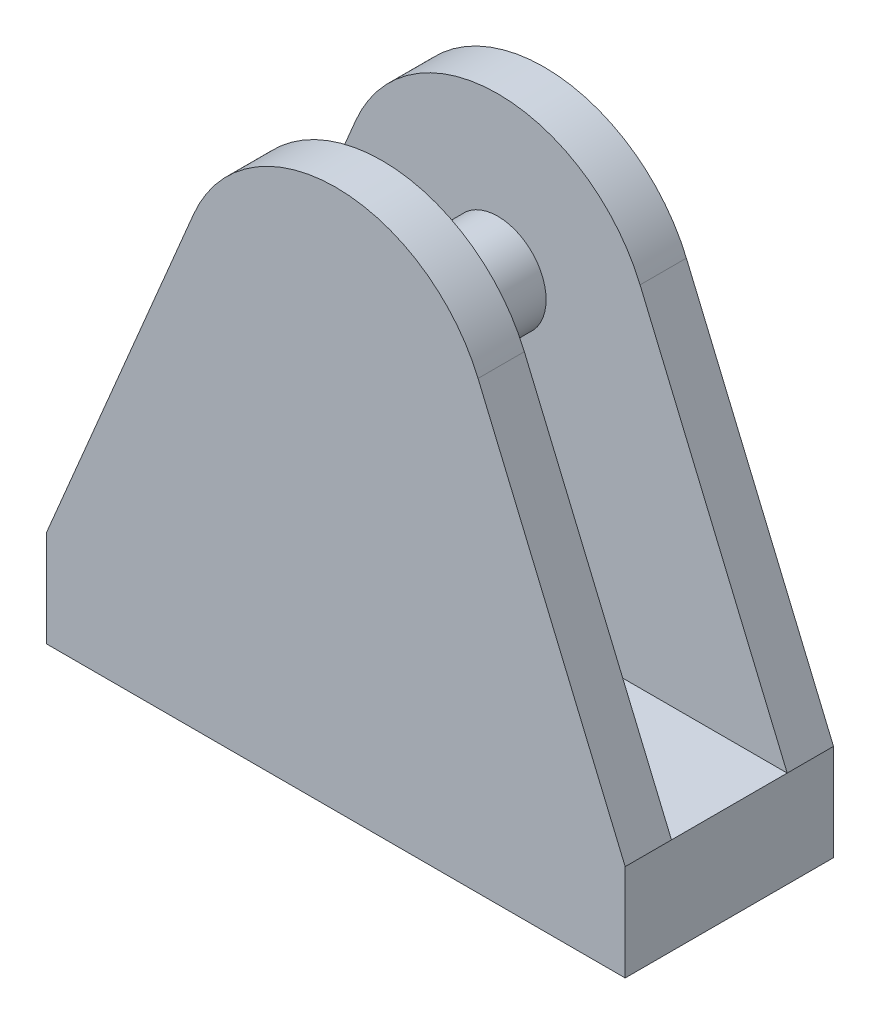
ISO-10303-21;
HEADER;
FILE_DESCRIPTION(('STEP AP214'),'2;1');
FILE_NAME('part.step','',(''),(''),'','','');
FILE_SCHEMA(('AUTOMOTIVE_DESIGN { 1 0 10303 214 1 1 1 1 }'));
ENDSEC;
DATA;
#1=APPLICATION_CONTEXT('core data for automotive mechanical design processes');
#2=APPLICATION_PROTOCOL_DEFINITION('international standard','automotive_design',2000,#1);
#3=PRODUCT_CONTEXT('',#1,'mechanical');
#4=PRODUCT('Part','Part','',(#3));
#5=PRODUCT_RELATED_PRODUCT_CATEGORY('part','',(#4));
#6=PRODUCT_DEFINITION_FORMATION('','',#4);
#7=PRODUCT_DEFINITION_CONTEXT('part definition',#1,'design');
#8=PRODUCT_DEFINITION('design','',#6,#7);
#9=PRODUCT_DEFINITION_SHAPE('','',#8);
#10=(LENGTH_UNIT() NAMED_UNIT(*) SI_UNIT(.MILLI.,.METRE.));
#11=(NAMED_UNIT(*) PLANE_ANGLE_UNIT() SI_UNIT($,.RADIAN.));
#12=(NAMED_UNIT(*) SI_UNIT($,.STERADIAN.) SOLID_ANGLE_UNIT());
#13=UNCERTAINTY_MEASURE_WITH_UNIT(LENGTH_MEASURE(1.E-05),#10,'distance_accuracy_value','');
#14=(GEOMETRIC_REPRESENTATION_CONTEXT(3) GLOBAL_UNCERTAINTY_ASSIGNED_CONTEXT((#13)) GLOBAL_UNIT_ASSIGNED_CONTEXT((#10,
#11,#12)) REPRESENTATION_CONTEXT('',''));
#15=CARTESIAN_POINT('',(0.,0.,0.));
#16=DIRECTION('',(0.,0.,1.));
#17=DIRECTION('',(1.,0.,0.));
#18=AXIS2_PLACEMENT_3D('',#15,#16,#17);
#19=CARTESIAN_POINT('',(150.,25.,54.));
#20=DIRECTION('',(-0.92156275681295,-0.388229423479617,0.));
#21=DIRECTION('',(0.388229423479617,-0.92156275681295,0.));
#22=AXIS2_PLACEMENT_3D('',#19,#20,#21);
#23=PLANE('',#22);
#24=DIRECTION('',(0.,0.,-1.));
#25=VECTOR('',#24,1.);
#26=CARTESIAN_POINT('',(150.,25.,54.));
#27=LINE('',#26,#25);
#28=CARTESIAN_POINT('',(150.,25.,54.));
#29=VERTEX_POINT('',#28);
#30=CARTESIAN_POINT('',(150.,25.,42.));
#31=VERTEX_POINT('',#30);
#32=EDGE_CURVE('E156',#29,#31,#27,.T.);
#33=ORIENTED_EDGE('',*,*,#32,.T.);
#34=DIRECTION('',(-0.388229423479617,0.92156275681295,0.));
#35=VECTOR('',#34,1.);
#36=CARTESIAN_POINT('',(150.,25.,42.));
#37=LINE('',#36,#35);
#38=CARTESIAN_POINT('',(111.862510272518,115.529176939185,42.));
#39=VERTEX_POINT('',#38);
#40=EDGE_CURVE('E122',#31,#39,#37,.T.);
#41=ORIENTED_EDGE('',*,*,#40,.T.);
#42=DIRECTION('',(0.,0.,-1.));
#43=VECTOR('',#42,1.);
#44=CARTESIAN_POINT('',(111.862510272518,115.529176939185,54.));
#45=LINE('',#44,#43);
#46=CARTESIAN_POINT('',(111.862510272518,115.529176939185,54.));
#47=VERTEX_POINT('',#46);
#48=EDGE_CURVE('E120',#47,#39,#45,.T.);
#49=ORIENTED_EDGE('',*,*,#48,.F.);
#50=DIRECTION('',(-0.388229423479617,0.92156275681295,0.));
#51=VECTOR('',#50,1.);
#52=CARTESIAN_POINT('',(150.,25.,54.));
#53=LINE('',#52,#51);
#54=EDGE_CURVE('E106',#29,#47,#53,.T.);
#55=ORIENTED_EDGE('',*,*,#54,.F.);
#56=EDGE_LOOP('',(#33,#41,#49,#55));
#57=FACE_BOUND('',#56,.T.);
#58=ADVANCED_FACE('F35',(#57),#23,.F.);
#59=CARTESIAN_POINT('',(75.,100.,54.));
#60=DIRECTION('',(0.,0.,-1.));
#61=DIRECTION('',(-1.,0.,0.));
#62=AXIS2_PLACEMENT_3D('',#59,#60,#61);
#63=CYLINDRICAL_SURFACE('',#62,40.);
#64=ORIENTED_EDGE('',*,*,#48,.T.);
#65=CARTESIAN_POINT('',(75.,100.,42.));
#66=DIRECTION('',(0.,0.,1.));
#67=DIRECTION('',(1.,0.,0.));
#68=AXIS2_PLACEMENT_3D('',#65,#66,#67);
#69=CIRCLE('',#68,40.);
#70=CARTESIAN_POINT('',(38.137489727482,115.529176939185,42.));
#71=VERTEX_POINT('',#70);
#72=EDGE_CURVE('E209',#39,#71,#69,.T.);
#73=ORIENTED_EDGE('',*,*,#72,.T.);
#74=DIRECTION('',(0.,0.,-1.));
#75=VECTOR('',#74,1.);
#76=CARTESIAN_POINT('',(38.137489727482,115.529176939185,54.));
#77=LINE('',#76,#75);
#78=CARTESIAN_POINT('',(38.137489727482,115.529176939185,54.));
#79=VERTEX_POINT('',#78);
#80=EDGE_CURVE('E130',#79,#71,#77,.T.);
#81=ORIENTED_EDGE('',*,*,#80,.F.);
#82=CARTESIAN_POINT('',(75.,100.,54.));
#83=DIRECTION('',(0.,0.,1.));
#84=DIRECTION('',(1.,0.,0.));
#85=AXIS2_PLACEMENT_3D('',#82,#83,#84);
#86=CIRCLE('',#85,40.);
#87=EDGE_CURVE('E110',#47,#79,#86,.T.);
#88=ORIENTED_EDGE('',*,*,#87,.F.);
#89=EDGE_LOOP('',(#64,#73,#81,#88));
#90=FACE_BOUND('',#89,.T.);
#91=ADVANCED_FACE('F128',(#90),#63,.T.);
#92=CARTESIAN_POINT('',(38.137489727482,115.529176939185,54.));
#93=DIRECTION('',(0.92156275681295,-0.388229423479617,0.));
#94=DIRECTION('',(0.388229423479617,0.92156275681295,0.));
#95=AXIS2_PLACEMENT_3D('',#92,#93,#94);
#96=PLANE('',#95);
#97=ORIENTED_EDGE('',*,*,#80,.T.);
#98=DIRECTION('',(-0.388229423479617,-0.92156275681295,0.));
#99=VECTOR('',#98,1.);
#100=CARTESIAN_POINT('',(38.137489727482,115.529176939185,42.));
#101=LINE('',#100,#99);
#102=CARTESIAN_POINT('',(0.,25.,42.));
#103=VERTEX_POINT('',#102);
#104=EDGE_CURVE('E11',#71,#103,#101,.T.);
#105=ORIENTED_EDGE('',*,*,#104,.T.);
#106=DIRECTION('',(0.,0.,-1.));
#107=VECTOR('',#106,1.);
#108=CARTESIAN_POINT('',(0.,25.,54.));
#109=LINE('',#108,#107);
#110=CARTESIAN_POINT('',(0.,25.,54.));
#111=VERTEX_POINT('',#110);
#112=EDGE_CURVE('E151',#111,#103,#109,.T.);
#113=ORIENTED_EDGE('',*,*,#112,.F.);
#114=DIRECTION('',(-0.388229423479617,-0.92156275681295,0.));
#115=VECTOR('',#114,1.);
#116=CARTESIAN_POINT('',(38.137489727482,115.529176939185,54.));
#117=LINE('',#116,#115);
#118=EDGE_CURVE('E60',#79,#111,#117,.T.);
#119=ORIENTED_EDGE('',*,*,#118,.F.);
#120=EDGE_LOOP('',(#97,#105,#113,#119));
#121=FACE_BOUND('',#120,.T.);
#122=ADVANCED_FACE('F249',(#121),#96,.F.);
#123=CARTESIAN_POINT('',(0.,25.,54.));
#124=DIRECTION('',(1.,0.,0.));
#125=DIRECTION('',(0.,1.,0.));
#126=AXIS2_PLACEMENT_3D('',#123,#124,#125);
#127=PLANE('',#126);
#128=DIRECTION('',(0.,-1.,0.));
#129=VECTOR('',#128,1.);
#130=CARTESIAN_POINT('',(0.,25.,0.));
#131=LINE('',#130,#129);
#132=CARTESIAN_POINT('',(0.,25.,0.));
#133=VERTEX_POINT('',#132);
#134=CARTESIAN_POINT('',(0.,0.,0.));
#135=VERTEX_POINT('',#134);
#136=EDGE_CURVE('E135',#133,#135,#131,.T.);
#137=ORIENTED_EDGE('',*,*,#136,.T.);
#138=DIRECTION('',(0.,0.,-1.));
#139=VECTOR('',#138,1.);
#140=CARTESIAN_POINT('',(0.,0.,54.));
#141=LINE('',#140,#139);
#142=CARTESIAN_POINT('',(0.,0.,54.));
#143=VERTEX_POINT('',#142);
#144=EDGE_CURVE('E161',#143,#135,#141,.T.);
#145=ORIENTED_EDGE('',*,*,#144,.F.);
#146=DIRECTION('',(0.,-1.,0.));
#147=VECTOR('',#146,1.);
#148=CARTESIAN_POINT('',(0.,25.,54.));
#149=LINE('',#148,#147);
#150=EDGE_CURVE('E150',#111,#143,#149,.T.);
#151=ORIENTED_EDGE('',*,*,#150,.F.);
#152=ORIENTED_EDGE('',*,*,#112,.T.);
#153=DIRECTION('',(0.,0.,-1.));
#154=VECTOR('',#153,1.);
#155=CARTESIAN_POINT('',(0.,25.,42.));
#156=LINE('',#155,#154);
#157=CARTESIAN_POINT('',(0.,25.,12.));
#158=VERTEX_POINT('',#157);
#159=EDGE_CURVE('E221',#103,#158,#156,.T.);
#160=ORIENTED_EDGE('',*,*,#159,.T.);
#161=EDGE_CURVE('E88',#158,#133,#109,.T.);
#162=ORIENTED_EDGE('',*,*,#161,.T.);
#163=EDGE_LOOP('',(#137,#145,#151,#152,#160,#162));
#164=FACE_BOUND('',#163,.T.);
#165=ADVANCED_FACE('F37',(#164),#127,.F.);
#166=CARTESIAN_POINT('',(0.,0.,54.));
#167=DIRECTION('',(0.,1.,0.));
#168=DIRECTION('',(0.,0.,1.));
#169=AXIS2_PLACEMENT_3D('',#166,#167,#168);
#170=PLANE('',#169);
#171=DIRECTION('',(1.,0.,0.));
#172=VECTOR('',#171,1.);
#173=CARTESIAN_POINT('',(0.,0.,0.));
#174=LINE('',#173,#172);
#175=CARTESIAN_POINT('',(150.,0.,0.));
#176=VERTEX_POINT('',#175);
#177=EDGE_CURVE('E137',#135,#176,#174,.T.);
#178=ORIENTED_EDGE('',*,*,#177,.T.);
#179=DIRECTION('',(0.,0.,-1.));
#180=VECTOR('',#179,1.);
#181=CARTESIAN_POINT('',(150.,0.,54.));
#182=LINE('',#181,#180);
#183=CARTESIAN_POINT('',(150.,0.,54.));
#184=VERTEX_POINT('',#183);
#185=EDGE_CURVE('E158',#184,#176,#182,.T.);
#186=ORIENTED_EDGE('',*,*,#185,.F.);
#187=DIRECTION('',(1.,0.,0.));
#188=VECTOR('',#187,1.);
#189=CARTESIAN_POINT('',(0.,0.,54.));
#190=LINE('',#189,#188);
#191=EDGE_CURVE('E97',#143,#184,#190,.T.);
#192=ORIENTED_EDGE('',*,*,#191,.F.);
#193=ORIENTED_EDGE('',*,*,#144,.T.);
#194=EDGE_LOOP('',(#178,#186,#192,#193));
#195=FACE_BOUND('',#194,.T.);
#196=ADVANCED_FACE('F187',(#195),#170,.F.);
#197=CARTESIAN_POINT('',(150.,0.,54.));
#198=DIRECTION('',(-1.,0.,0.));
#199=DIRECTION('',(0.,0.,1.));
#200=AXIS2_PLACEMENT_3D('',#197,#198,#199);
#201=PLANE('',#200);
#202=DIRECTION('',(0.,1.,0.));
#203=VECTOR('',#202,1.);
#204=CARTESIAN_POINT('',(150.,0.,0.));
#205=LINE('',#204,#203);
#206=CARTESIAN_POINT('',(150.,25.,0.));
#207=VERTEX_POINT('',#206);
#208=EDGE_CURVE('E139',#176,#207,#205,.T.);
#209=ORIENTED_EDGE('',*,*,#208,.T.);
#210=CARTESIAN_POINT('',(150.,25.,12.));
#211=VERTEX_POINT('',#210);
#212=EDGE_CURVE('E125',#211,#207,#27,.T.);
#213=ORIENTED_EDGE('',*,*,#212,.F.);
#214=DIRECTION('',(0.,0.,-1.));
#215=VECTOR('',#214,1.);
#216=CARTESIAN_POINT('',(150.,25.,42.));
#217=LINE('',#216,#215);
#218=EDGE_CURVE('E199',#31,#211,#217,.T.);
#219=ORIENTED_EDGE('',*,*,#218,.F.);
#220=ORIENTED_EDGE('',*,*,#32,.F.);
#221=DIRECTION('',(0.,1.,0.));
#222=VECTOR('',#221,1.);
#223=CARTESIAN_POINT('',(150.,0.,54.));
#224=LINE('',#223,#222);
#225=EDGE_CURVE('E113',#184,#29,#224,.T.);
#226=ORIENTED_EDGE('',*,*,#225,.F.);
#227=ORIENTED_EDGE('',*,*,#185,.T.);
#228=EDGE_LOOP('',(#209,#213,#219,#220,#226,#227));
#229=FACE_BOUND('',#228,.T.);
#230=ADVANCED_FACE('F189',(#229),#201,.F.);
#231=CARTESIAN_POINT('',(111.862510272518,115.529176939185,12.));
#232=VERTEX_POINT('',#231);
#233=CARTESIAN_POINT('',(111.862510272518,115.529176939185,0.));
#234=VERTEX_POINT('',#233);
#235=EDGE_CURVE('E126',#232,#234,#45,.T.);
#236=ORIENTED_EDGE('',*,*,#235,.F.);
#237=DIRECTION('',(0.388229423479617,-0.92156275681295,0.));
#238=VECTOR('',#237,1.);
#239=CARTESIAN_POINT('',(150.,25.,12.));
#240=LINE('',#239,#238);
#241=EDGE_CURVE('E196',#232,#211,#240,.T.);
#242=ORIENTED_EDGE('',*,*,#241,.T.);
#243=ORIENTED_EDGE('',*,*,#212,.T.);
#244=DIRECTION('',(-0.388229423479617,0.92156275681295,0.));
#245=VECTOR('',#244,1.);
#246=CARTESIAN_POINT('',(150.,25.,0.));
#247=LINE('',#246,#245);
#248=EDGE_CURVE('E142',#207,#234,#247,.T.);
#249=ORIENTED_EDGE('',*,*,#248,.T.);
#250=EDGE_LOOP('',(#236,#242,#243,#249));
#251=FACE_BOUND('',#250,.T.);
#252=ADVANCED_FACE('F192',(#251),#23,.F.);
#253=CARTESIAN_POINT('',(38.137489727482,115.529176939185,12.));
#254=VERTEX_POINT('',#253);
#255=CARTESIAN_POINT('',(38.137489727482,115.529176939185,0.));
#256=VERTEX_POINT('',#255);
#257=EDGE_CURVE('E154',#254,#256,#77,.T.);
#258=ORIENTED_EDGE('',*,*,#257,.F.);
#259=CARTESIAN_POINT('',(75.,100.,12.));
#260=DIRECTION('',(0.,0.,-1.));
#261=DIRECTION('',(-1.,0.,0.));
#262=AXIS2_PLACEMENT_3D('',#259,#260,#261);
#263=CIRCLE('',#262,40.);
#264=EDGE_CURVE('E176',#254,#232,#263,.T.);
#265=ORIENTED_EDGE('',*,*,#264,.T.);
#266=ORIENTED_EDGE('',*,*,#235,.T.);
#267=CARTESIAN_POINT('',(75.,100.,0.));
#268=DIRECTION('',(0.,0.,1.));
#269=DIRECTION('',(1.,0.,0.));
#270=AXIS2_PLACEMENT_3D('',#267,#268,#269);
#271=CIRCLE('',#270,40.);
#272=EDGE_CURVE('E145',#234,#256,#271,.T.);
#273=ORIENTED_EDGE('',*,*,#272,.T.);
#274=EDGE_LOOP('',(#258,#265,#266,#273));
#275=FACE_BOUND('',#274,.T.);
#276=ADVANCED_FACE('F175',(#275),#63,.T.);
#277=ORIENTED_EDGE('',*,*,#161,.F.);
#278=DIRECTION('',(0.388229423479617,0.92156275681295,0.));
#279=VECTOR('',#278,1.);
#280=CARTESIAN_POINT('',(38.137489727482,115.529176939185,12.));
#281=LINE('',#280,#279);
#282=EDGE_CURVE('E44',#158,#254,#281,.T.);
#283=ORIENTED_EDGE('',*,*,#282,.T.);
#284=ORIENTED_EDGE('',*,*,#257,.T.);
#285=DIRECTION('',(-0.388229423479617,-0.92156275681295,0.));
#286=VECTOR('',#285,1.);
#287=CARTESIAN_POINT('',(38.137489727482,115.529176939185,0.));
#288=LINE('',#287,#286);
#289=EDGE_CURVE('E148',#256,#133,#288,.T.);
#290=ORIENTED_EDGE('',*,*,#289,.T.);
#291=EDGE_LOOP('',(#277,#283,#284,#290));
#292=FACE_BOUND('',#291,.T.);
#293=ADVANCED_FACE('F167',(#292),#96,.F.);
#294=CARTESIAN_POINT('',(75.,100.,54.));
#295=DIRECTION('',(0.,0.,1.));
#296=DIRECTION('',(1.,0.,0.));
#297=AXIS2_PLACEMENT_3D('',#294,#295,#296);
#298=PLANE('',#297);
#299=ORIENTED_EDGE('',*,*,#150,.T.);
#300=ORIENTED_EDGE('',*,*,#191,.T.);
#301=ORIENTED_EDGE('',*,*,#225,.T.);
#302=ORIENTED_EDGE('',*,*,#54,.T.);
#303=ORIENTED_EDGE('',*,*,#87,.T.);
#304=ORIENTED_EDGE('',*,*,#118,.T.);
#305=EDGE_LOOP('',(#299,#300,#301,#302,#303,#304));
#306=FACE_BOUND('',#305,.T.);
#307=ADVANCED_FACE('F108',(#306),#298,.T.);
#308=CARTESIAN_POINT('',(75.,100.,0.));
#309=DIRECTION('',(0.,0.,1.));
#310=DIRECTION('',(1.,0.,0.));
#311=AXIS2_PLACEMENT_3D('',#308,#309,#310);
#312=PLANE('',#311);
#313=ORIENTED_EDGE('',*,*,#136,.F.);
#314=ORIENTED_EDGE('',*,*,#289,.F.);
#315=ORIENTED_EDGE('',*,*,#272,.F.);
#316=ORIENTED_EDGE('',*,*,#248,.F.);
#317=ORIENTED_EDGE('',*,*,#208,.F.);
#318=ORIENTED_EDGE('',*,*,#177,.F.);
#319=EDGE_LOOP('',(#313,#314,#315,#316,#317,#318));
#320=FACE_BOUND('',#319,.T.);
#321=ADVANCED_FACE('F183',(#320),#312,.F.);
#322=CARTESIAN_POINT('',(0.,25.,42.));
#323=DIRECTION('',(0.,0.,1.));
#324=DIRECTION('',(1.,0.,0.));
#325=AXIS2_PLACEMENT_3D('',#322,#323,#324);
#326=PLANE('',#325);
#327=CARTESIAN_POINT('',(75.,100.,42.));
#328=DIRECTION('',(0.,0.,1.));
#329=DIRECTION('',(1.,0.,0.));
#330=AXIS2_PLACEMENT_3D('',#327,#328,#329);
#331=CIRCLE('',#330,12.5);
#332=CARTESIAN_POINT('',(87.5,100.,42.));
#333=VERTEX_POINT('',#332);
#334=EDGE_CURVE('E224',#333,#333,#331,.T.);
#335=ORIENTED_EDGE('',*,*,#334,.T.);
#336=EDGE_LOOP('',(#335));
#337=FACE_BOUND('',#336,.T.);
#338=DIRECTION('',(1.,0.,0.));
#339=VECTOR('',#338,1.);
#340=CARTESIAN_POINT('',(0.,25.,42.));
#341=LINE('',#340,#339);
#342=EDGE_CURVE('E219',#103,#31,#341,.T.);
#343=ORIENTED_EDGE('',*,*,#342,.F.);
#344=ORIENTED_EDGE('',*,*,#104,.F.);
#345=ORIENTED_EDGE('',*,*,#72,.F.);
#346=ORIENTED_EDGE('',*,*,#40,.F.);
#347=EDGE_LOOP('',(#343,#344,#345,#346));
#348=FACE_BOUND('',#347,.T.);
#349=ADVANCED_FACE('F210',(#337,#348),#326,.F.);
#350=CARTESIAN_POINT('',(0.,25.,12.));
#351=DIRECTION('',(0.,0.,-1.));
#352=DIRECTION('',(-1.,0.,0.));
#353=AXIS2_PLACEMENT_3D('',#350,#351,#352);
#354=PLANE('',#353);
#355=CARTESIAN_POINT('',(75.,100.,12.));
#356=DIRECTION('',(0.,0.,-1.));
#357=DIRECTION('',(-1.,0.,0.));
#358=AXIS2_PLACEMENT_3D('',#355,#356,#357);
#359=CIRCLE('',#358,12.5);
#360=CARTESIAN_POINT('',(62.5,100.,12.));
#361=VERTEX_POINT('',#360);
#362=EDGE_CURVE('E39',#361,#361,#359,.T.);
#363=ORIENTED_EDGE('',*,*,#362,.T.);
#364=EDGE_LOOP('',(#363));
#365=FACE_BOUND('',#364,.T.);
#366=ORIENTED_EDGE('',*,*,#264,.F.);
#367=ORIENTED_EDGE('',*,*,#282,.F.);
#368=DIRECTION('',(1.,0.,0.));
#369=VECTOR('',#368,1.);
#370=CARTESIAN_POINT('',(0.,25.,12.));
#371=LINE('',#370,#369);
#372=EDGE_CURVE('E51',#158,#211,#371,.T.);
#373=ORIENTED_EDGE('',*,*,#372,.T.);
#374=ORIENTED_EDGE('',*,*,#241,.F.);
#375=EDGE_LOOP('',(#366,#367,#373,#374));
#376=FACE_BOUND('',#375,.T.);
#377=ADVANCED_FACE('F232',(#365,#376),#354,.F.);
#378=CARTESIAN_POINT('',(0.,25.,42.));
#379=DIRECTION('',(0.,-1.,0.));
#380=DIRECTION('',(0.,0.,-1.));
#381=AXIS2_PLACEMENT_3D('',#378,#379,#380);
#382=PLANE('',#381);
#383=ORIENTED_EDGE('',*,*,#218,.T.);
#384=ORIENTED_EDGE('',*,*,#372,.F.);
#385=ORIENTED_EDGE('',*,*,#159,.F.);
#386=ORIENTED_EDGE('',*,*,#342,.T.);
#387=EDGE_LOOP('',(#383,#384,#385,#386));
#388=FACE_BOUND('',#387,.T.);
#389=ADVANCED_FACE('F237',(#388),#382,.F.);
#390=CARTESIAN_POINT('',(75.,100.,0.));
#391=DIRECTION('',(0.,0.,1.));
#392=DIRECTION('',(1.,0.,0.));
#393=AXIS2_PLACEMENT_3D('',#390,#391,#392);
#394=CYLINDRICAL_SURFACE('',#393,12.5);
#395=ORIENTED_EDGE('',*,*,#362,.F.);
#396=EDGE_LOOP('',(#395));
#397=FACE_BOUND('',#396,.T.);
#398=ORIENTED_EDGE('',*,*,#334,.F.);
#399=EDGE_LOOP('',(#398));
#400=FACE_BOUND('',#399,.T.);
#401=ADVANCED_FACE('F234',(#397,#400),#394,.T.);
#402=CLOSED_SHELL('',(#58,#91,#122,#165,#196,#230,#252,#276,#293,#307,#321,#349,#377,#389,#401));
#403=MANIFOLD_SOLID_BREP('B2',#402);
#404=ADVANCED_BREP_SHAPE_REPRESENTATION('',(#18,#403),#14);
#405=SHAPE_DEFINITION_REPRESENTATION(#9,#404);
ENDSEC;
END-ISO-10303-21;
